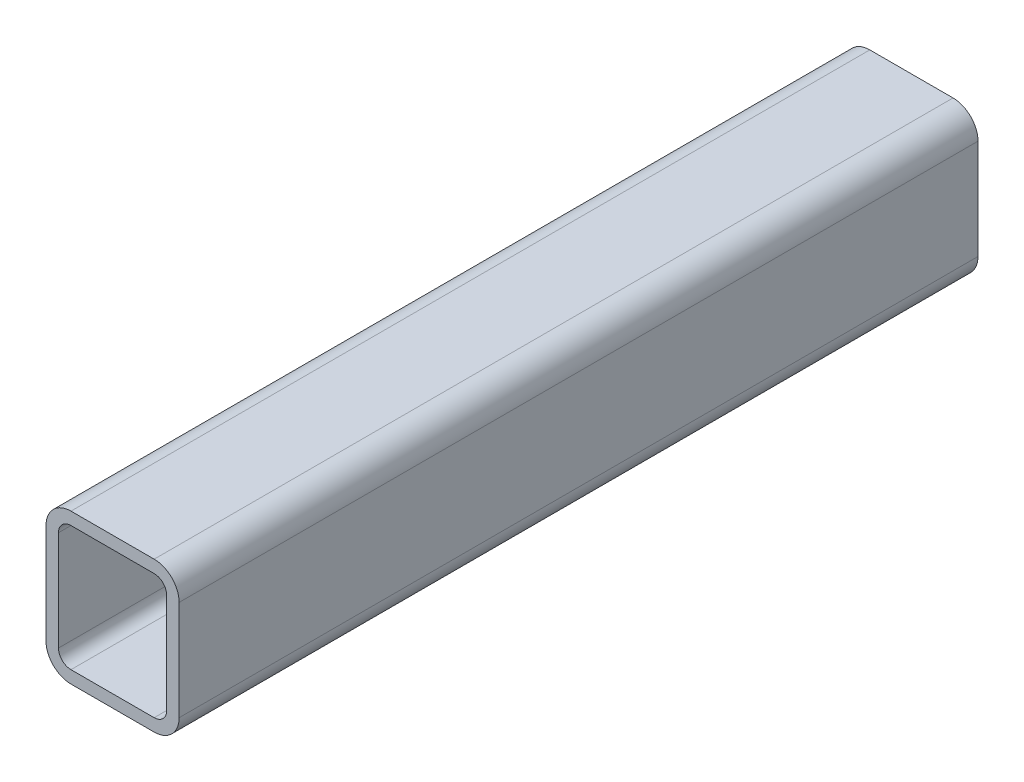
ISO-10303-21;
HEADER;
FILE_DESCRIPTION(('STEP AP214'),'2;1');
FILE_NAME('part.step','',(''),(''),'','','');
FILE_SCHEMA(('AUTOMOTIVE_DESIGN { 1 0 10303 214 1 1 1 1 }'));
ENDSEC;
DATA;
#1=APPLICATION_CONTEXT('core data for automotive mechanical design processes');
#2=APPLICATION_PROTOCOL_DEFINITION('international standard','automotive_design',2000,#1);
#3=PRODUCT_CONTEXT('',#1,'mechanical');
#4=PRODUCT('Part','Part','',(#3));
#5=PRODUCT_RELATED_PRODUCT_CATEGORY('part','',(#4));
#6=PRODUCT_DEFINITION_FORMATION('','',#4);
#7=PRODUCT_DEFINITION_CONTEXT('part definition',#1,'design');
#8=PRODUCT_DEFINITION('design','',#6,#7);
#9=PRODUCT_DEFINITION_SHAPE('','',#8);
#10=(LENGTH_UNIT() NAMED_UNIT(*) SI_UNIT(.MILLI.,.METRE.));
#11=(NAMED_UNIT(*) PLANE_ANGLE_UNIT() SI_UNIT($,.RADIAN.));
#12=(NAMED_UNIT(*) SI_UNIT($,.STERADIAN.) SOLID_ANGLE_UNIT());
#13=UNCERTAINTY_MEASURE_WITH_UNIT(LENGTH_MEASURE(1.E-05),#10,'distance_accuracy_value','');
#14=(GEOMETRIC_REPRESENTATION_CONTEXT(3) GLOBAL_UNCERTAINTY_ASSIGNED_CONTEXT((#13)) GLOBAL_UNIT_ASSIGNED_CONTEXT((#10,
#11,#12)) REPRESENTATION_CONTEXT('',''));
#15=CARTESIAN_POINT('',(0.,0.,0.));
#16=DIRECTION('',(0.,0.,1.));
#17=DIRECTION('',(1.,0.,0.));
#18=AXIS2_PLACEMENT_3D('',#15,#16,#17);
#19=CARTESIAN_POINT('',(9.525,47.625,304.8));
#20=DIRECTION('',(0.,0.,1.));
#21=DIRECTION('',(1.,0.,0.));
#22=AXIS2_PLACEMENT_3D('',#19,#20,#21);
#23=PLANE('',#22);
#24=CARTESIAN_POINT('',(9.525,47.625,304.8));
#25=DIRECTION('',(0.,0.,1.));
#26=DIRECTION('',(1.,0.,0.));
#27=AXIS2_PLACEMENT_3D('',#24,#25,#26);
#28=CIRCLE('',#27,9.52500000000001);
#29=CARTESIAN_POINT('',(9.525,57.15,304.8));
#30=VERTEX_POINT('',#29);
#31=CARTESIAN_POINT('',(0.,47.625,304.8));
#32=VERTEX_POINT('',#31);
#33=EDGE_CURVE('E211',#30,#32,#28,.T.);
#34=ORIENTED_EDGE('',*,*,#33,.T.);
#35=DIRECTION('',(0.,-1.,0.));
#36=VECTOR('',#35,1.);
#37=CARTESIAN_POINT('',(0.,9.52500000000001,304.8));
#38=LINE('',#37,#36);
#39=CARTESIAN_POINT('',(0.,9.52500000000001,304.8));
#40=VERTEX_POINT('',#39);
#41=EDGE_CURVE('E214',#32,#40,#38,.T.);
#42=ORIENTED_EDGE('',*,*,#41,.T.);
#43=CARTESIAN_POINT('',(9.525,9.52500000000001,304.8));
#44=DIRECTION('',(0.,0.,1.));
#45=DIRECTION('',(1.,0.,0.));
#46=AXIS2_PLACEMENT_3D('',#43,#44,#45);
#47=CIRCLE('',#46,9.525);
#48=CARTESIAN_POINT('',(9.525,0.,304.8));
#49=VERTEX_POINT('',#48);
#50=EDGE_CURVE('E217',#40,#49,#47,.T.);
#51=ORIENTED_EDGE('',*,*,#50,.T.);
#52=DIRECTION('',(1.,0.,0.));
#53=VECTOR('',#52,1.);
#54=CARTESIAN_POINT('',(41.275,0.,304.8));
#55=LINE('',#54,#53);
#56=CARTESIAN_POINT('',(41.275,0.,304.8));
#57=VERTEX_POINT('',#56);
#58=EDGE_CURVE('E219',#49,#57,#55,.T.);
#59=ORIENTED_EDGE('',*,*,#58,.T.);
#60=CARTESIAN_POINT('',(41.275,9.52500000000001,304.8));
#61=DIRECTION('',(0.,0.,1.));
#62=DIRECTION('',(1.,0.,0.));
#63=AXIS2_PLACEMENT_3D('',#60,#61,#62);
#64=CIRCLE('',#63,9.525);
#65=CARTESIAN_POINT('',(50.8,9.52500000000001,304.8));
#66=VERTEX_POINT('',#65);
#67=EDGE_CURVE('E221',#57,#66,#64,.T.);
#68=ORIENTED_EDGE('',*,*,#67,.T.);
#69=DIRECTION('',(0.,1.,0.));
#70=VECTOR('',#69,1.);
#71=CARTESIAN_POINT('',(50.8,47.625,304.8));
#72=LINE('',#71,#70);
#73=CARTESIAN_POINT('',(50.8,47.625,304.8));
#74=VERTEX_POINT('',#73);
#75=EDGE_CURVE('E223',#66,#74,#72,.T.);
#76=ORIENTED_EDGE('',*,*,#75,.T.);
#77=CARTESIAN_POINT('',(41.275,47.625,304.8));
#78=DIRECTION('',(0.,0.,1.));
#79=DIRECTION('',(1.,0.,0.));
#80=AXIS2_PLACEMENT_3D('',#77,#78,#79);
#81=CIRCLE('',#80,9.525);
#82=CARTESIAN_POINT('',(41.275,57.15,304.8));
#83=VERTEX_POINT('',#82);
#84=EDGE_CURVE('E225',#74,#83,#81,.T.);
#85=ORIENTED_EDGE('',*,*,#84,.T.);
#86=DIRECTION('',(-1.,0.,0.));
#87=VECTOR('',#86,1.);
#88=CARTESIAN_POINT('',(9.525,57.15,304.8));
#89=LINE('',#88,#87);
#90=EDGE_CURVE('E227',#83,#30,#89,.T.);
#91=ORIENTED_EDGE('',*,*,#90,.T.);
#92=EDGE_LOOP('',(#34,#42,#51,#59,#68,#76,#85,#91));
#93=FACE_BOUND('',#92,.T.);
#94=DIRECTION('',(0.,-1.,0.));
#95=VECTOR('',#94,1.);
#96=CARTESIAN_POINT('',(4.7625,9.52500000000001,304.8));
#97=LINE('',#96,#95);
#98=CARTESIAN_POINT('',(4.7625,47.625,304.8));
#99=VERTEX_POINT('',#98);
#100=CARTESIAN_POINT('',(4.7625,9.52500000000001,304.8));
#101=VERTEX_POINT('',#100);
#102=EDGE_CURVE('E154',#99,#101,#97,.T.);
#103=ORIENTED_EDGE('',*,*,#102,.F.);
#104=CARTESIAN_POINT('',(9.525,47.625,304.8));
#105=DIRECTION('',(0.,0.,1.));
#106=DIRECTION('',(1.,0.,0.));
#107=AXIS2_PLACEMENT_3D('',#104,#105,#106);
#108=CIRCLE('',#107,4.7625);
#109=CARTESIAN_POINT('',(9.525,52.3875,304.8));
#110=VERTEX_POINT('',#109);
#111=EDGE_CURVE('E146',#110,#99,#108,.T.);
#112=ORIENTED_EDGE('',*,*,#111,.F.);
#113=DIRECTION('',(-1.,0.,0.));
#114=VECTOR('',#113,1.);
#115=CARTESIAN_POINT('',(9.525,52.3875,304.8));
#116=LINE('',#115,#114);
#117=CARTESIAN_POINT('',(41.275,52.3875,304.8));
#118=VERTEX_POINT('',#117);
#119=EDGE_CURVE('E179',#118,#110,#116,.T.);
#120=ORIENTED_EDGE('',*,*,#119,.F.);
#121=CARTESIAN_POINT('',(41.275,47.625,304.8));
#122=DIRECTION('',(0.,0.,1.));
#123=DIRECTION('',(1.,0.,0.));
#124=AXIS2_PLACEMENT_3D('',#121,#122,#123);
#125=CIRCLE('',#124,4.7625);
#126=CARTESIAN_POINT('',(46.0375,47.625,304.8));
#127=VERTEX_POINT('',#126);
#128=EDGE_CURVE('E177',#127,#118,#125,.T.);
#129=ORIENTED_EDGE('',*,*,#128,.F.);
#130=DIRECTION('',(0.,1.,0.));
#131=VECTOR('',#130,1.);
#132=CARTESIAN_POINT('',(46.0375,47.625,304.8));
#133=LINE('',#132,#131);
#134=CARTESIAN_POINT('',(46.0375,9.52500000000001,304.8));
#135=VERTEX_POINT('',#134);
#136=EDGE_CURVE('E175',#135,#127,#133,.T.);
#137=ORIENTED_EDGE('',*,*,#136,.F.);
#138=CARTESIAN_POINT('',(41.275,9.52500000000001,304.8));
#139=DIRECTION('',(0.,0.,1.));
#140=DIRECTION('',(1.,0.,0.));
#141=AXIS2_PLACEMENT_3D('',#138,#139,#140);
#142=CIRCLE('',#141,4.7625);
#143=CARTESIAN_POINT('',(41.275,4.7625,304.8));
#144=VERTEX_POINT('',#143);
#145=EDGE_CURVE('E173',#144,#135,#142,.T.);
#146=ORIENTED_EDGE('',*,*,#145,.F.);
#147=DIRECTION('',(1.,0.,0.));
#148=VECTOR('',#147,1.);
#149=CARTESIAN_POINT('',(41.275,4.76250000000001,304.8));
#150=LINE('',#149,#148);
#151=CARTESIAN_POINT('',(9.525,4.76250000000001,304.8));
#152=VERTEX_POINT('',#151);
#153=EDGE_CURVE('E169',#152,#144,#150,.T.);
#154=ORIENTED_EDGE('',*,*,#153,.F.);
#155=CARTESIAN_POINT('',(9.525,9.52500000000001,304.8));
#156=DIRECTION('',(0.,0.,1.));
#157=DIRECTION('',(1.,0.,0.));
#158=AXIS2_PLACEMENT_3D('',#155,#156,#157);
#159=CIRCLE('',#158,4.7625);
#160=EDGE_CURVE('E167',#101,#152,#159,.T.);
#161=ORIENTED_EDGE('',*,*,#160,.F.);
#162=EDGE_LOOP('',(#103,#112,#120,#129,#137,#146,#154,#161));
#163=FACE_BOUND('',#162,.T.);
#164=ADVANCED_FACE('F33',(#93,#163),#23,.T.);
#165=CARTESIAN_POINT('',(9.525,47.625,0.));
#166=DIRECTION('',(0.,0.,1.));
#167=DIRECTION('',(1.,0.,0.));
#168=AXIS2_PLACEMENT_3D('',#165,#166,#167);
#169=PLANE('',#168);
#170=CARTESIAN_POINT('',(9.525,47.625,0.));
#171=DIRECTION('',(0.,0.,1.));
#172=DIRECTION('',(1.,0.,0.));
#173=AXIS2_PLACEMENT_3D('',#170,#171,#172);
#174=CIRCLE('',#173,9.52500000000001);
#175=CARTESIAN_POINT('',(9.525,57.15,0.));
#176=VERTEX_POINT('',#175);
#177=CARTESIAN_POINT('',(0.,47.625,0.));
#178=VERTEX_POINT('',#177);
#179=EDGE_CURVE('E162',#176,#178,#174,.T.);
#180=ORIENTED_EDGE('',*,*,#179,.F.);
#181=DIRECTION('',(-1.,0.,0.));
#182=VECTOR('',#181,1.);
#183=CARTESIAN_POINT('',(9.525,57.15,0.));
#184=LINE('',#183,#182);
#185=CARTESIAN_POINT('',(41.275,57.15,0.));
#186=VERTEX_POINT('',#185);
#187=EDGE_CURVE('E215',#186,#176,#184,.T.);
#188=ORIENTED_EDGE('',*,*,#187,.F.);
#189=CARTESIAN_POINT('',(41.275,47.625,0.));
#190=DIRECTION('',(0.,0.,1.));
#191=DIRECTION('',(1.,0.,0.));
#192=AXIS2_PLACEMENT_3D('',#189,#190,#191);
#193=CIRCLE('',#192,9.525);
#194=CARTESIAN_POINT('',(50.8,47.625,0.));
#195=VERTEX_POINT('',#194);
#196=EDGE_CURVE('E242',#195,#186,#193,.T.);
#197=ORIENTED_EDGE('',*,*,#196,.F.);
#198=DIRECTION('',(0.,1.,0.));
#199=VECTOR('',#198,1.);
#200=CARTESIAN_POINT('',(50.8,47.625,0.));
#201=LINE('',#200,#199);
#202=CARTESIAN_POINT('',(50.8,9.52500000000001,0.));
#203=VERTEX_POINT('',#202);
#204=EDGE_CURVE('E240',#203,#195,#201,.T.);
#205=ORIENTED_EDGE('',*,*,#204,.F.);
#206=CARTESIAN_POINT('',(41.275,9.52500000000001,0.));
#207=DIRECTION('',(0.,0.,1.));
#208=DIRECTION('',(1.,0.,0.));
#209=AXIS2_PLACEMENT_3D('',#206,#207,#208);
#210=CIRCLE('',#209,9.525);
#211=CARTESIAN_POINT('',(41.275,0.,0.));
#212=VERTEX_POINT('',#211);
#213=EDGE_CURVE('E238',#212,#203,#210,.T.);
#214=ORIENTED_EDGE('',*,*,#213,.F.);
#215=DIRECTION('',(1.,0.,0.));
#216=VECTOR('',#215,1.);
#217=CARTESIAN_POINT('',(41.275,0.,0.));
#218=LINE('',#217,#216);
#219=CARTESIAN_POINT('',(9.525,0.,0.));
#220=VERTEX_POINT('',#219);
#221=EDGE_CURVE('E236',#220,#212,#218,.T.);
#222=ORIENTED_EDGE('',*,*,#221,.F.);
#223=CARTESIAN_POINT('',(9.525,9.52500000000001,0.));
#224=DIRECTION('',(0.,0.,1.));
#225=DIRECTION('',(1.,0.,0.));
#226=AXIS2_PLACEMENT_3D('',#223,#224,#225);
#227=CIRCLE('',#226,9.525);
#228=CARTESIAN_POINT('',(0.,9.52500000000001,0.));
#229=VERTEX_POINT('',#228);
#230=EDGE_CURVE('E234',#229,#220,#227,.T.);
#231=ORIENTED_EDGE('',*,*,#230,.F.);
#232=DIRECTION('',(0.,-1.,0.));
#233=VECTOR('',#232,1.);
#234=CARTESIAN_POINT('',(0.,9.52500000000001,0.));
#235=LINE('',#234,#233);
#236=EDGE_CURVE('E232',#178,#229,#235,.T.);
#237=ORIENTED_EDGE('',*,*,#236,.F.);
#238=EDGE_LOOP('',(#180,#188,#197,#205,#214,#222,#231,#237));
#239=FACE_BOUND('',#238,.T.);
#240=CARTESIAN_POINT('',(9.525,47.625,0.));
#241=DIRECTION('',(0.,0.,1.));
#242=DIRECTION('',(1.,0.,0.));
#243=AXIS2_PLACEMENT_3D('',#240,#241,#242);
#244=CIRCLE('',#243,4.7625);
#245=CARTESIAN_POINT('',(9.525,52.3875,0.));
#246=VERTEX_POINT('',#245);
#247=CARTESIAN_POINT('',(4.7625,47.625,0.));
#248=VERTEX_POINT('',#247);
#249=EDGE_CURVE('E56',#246,#248,#244,.T.);
#250=ORIENTED_EDGE('',*,*,#249,.T.);
#251=DIRECTION('',(0.,-1.,0.));
#252=VECTOR('',#251,1.);
#253=CARTESIAN_POINT('',(4.7625,9.52500000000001,0.));
#254=LINE('',#253,#252);
#255=CARTESIAN_POINT('',(4.7625,9.52500000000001,0.));
#256=VERTEX_POINT('',#255);
#257=EDGE_CURVE('E161',#248,#256,#254,.T.);
#258=ORIENTED_EDGE('',*,*,#257,.T.);
#259=CARTESIAN_POINT('',(9.525,9.52500000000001,0.));
#260=DIRECTION('',(0.,0.,1.));
#261=DIRECTION('',(1.,0.,0.));
#262=AXIS2_PLACEMENT_3D('',#259,#260,#261);
#263=CIRCLE('',#262,4.7625);
#264=CARTESIAN_POINT('',(9.525,4.76250000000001,0.));
#265=VERTEX_POINT('',#264);
#266=EDGE_CURVE('E183',#256,#265,#263,.T.);
#267=ORIENTED_EDGE('',*,*,#266,.T.);
#268=DIRECTION('',(1.,0.,0.));
#269=VECTOR('',#268,1.);
#270=CARTESIAN_POINT('',(41.275,4.76250000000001,0.));
#271=LINE('',#270,#269);
#272=CARTESIAN_POINT('',(41.275,4.7625,0.));
#273=VERTEX_POINT('',#272);
#274=EDGE_CURVE('E186',#265,#273,#271,.T.);
#275=ORIENTED_EDGE('',*,*,#274,.T.);
#276=CARTESIAN_POINT('',(41.275,9.52500000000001,0.));
#277=DIRECTION('',(0.,0.,1.));
#278=DIRECTION('',(1.,0.,0.));
#279=AXIS2_PLACEMENT_3D('',#276,#277,#278);
#280=CIRCLE('',#279,4.7625);
#281=CARTESIAN_POINT('',(46.0375,9.52500000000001,0.));
#282=VERTEX_POINT('',#281);
#283=EDGE_CURVE('E189',#273,#282,#280,.T.);
#284=ORIENTED_EDGE('',*,*,#283,.T.);
#285=DIRECTION('',(0.,1.,0.));
#286=VECTOR('',#285,1.);
#287=CARTESIAN_POINT('',(46.0375,47.625,0.));
#288=LINE('',#287,#286);
#289=CARTESIAN_POINT('',(46.0375,47.625,0.));
#290=VERTEX_POINT('',#289);
#291=EDGE_CURVE('E192',#282,#290,#288,.T.);
#292=ORIENTED_EDGE('',*,*,#291,.T.);
#293=CARTESIAN_POINT('',(41.275,47.625,0.));
#294=DIRECTION('',(0.,0.,1.));
#295=DIRECTION('',(1.,0.,0.));
#296=AXIS2_PLACEMENT_3D('',#293,#294,#295);
#297=CIRCLE('',#296,4.7625);
#298=CARTESIAN_POINT('',(41.275,52.3875,0.));
#299=VERTEX_POINT('',#298);
#300=EDGE_CURVE('E195',#290,#299,#297,.T.);
#301=ORIENTED_EDGE('',*,*,#300,.T.);
#302=DIRECTION('',(-1.,0.,0.));
#303=VECTOR('',#302,1.);
#304=CARTESIAN_POINT('',(9.525,52.3875,0.));
#305=LINE('',#304,#303);
#306=EDGE_CURVE('E155',#299,#246,#305,.T.);
#307=ORIENTED_EDGE('',*,*,#306,.T.);
#308=EDGE_LOOP('',(#250,#258,#267,#275,#284,#292,#301,#307));
#309=FACE_BOUND('',#308,.T.);
#310=ADVANCED_FACE('F272',(#239,#309),#169,.F.);
#311=CARTESIAN_POINT('',(9.525,47.625,304.8));
#312=DIRECTION('',(0.,0.,-1.));
#313=DIRECTION('',(-1.,0.,0.));
#314=AXIS2_PLACEMENT_3D('',#311,#312,#313);
#315=CYLINDRICAL_SURFACE('',#314,9.52500000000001);
#316=ORIENTED_EDGE('',*,*,#179,.T.);
#317=DIRECTION('',(0.,0.,-1.));
#318=VECTOR('',#317,1.);
#319=CARTESIAN_POINT('',(0.,47.625,304.8));
#320=LINE('',#319,#318);
#321=EDGE_CURVE('E11',#32,#178,#320,.T.);
#322=ORIENTED_EDGE('',*,*,#321,.F.);
#323=ORIENTED_EDGE('',*,*,#33,.F.);
#324=DIRECTION('',(0.,0.,-1.));
#325=VECTOR('',#324,1.);
#326=CARTESIAN_POINT('',(9.525,57.15,304.8));
#327=LINE('',#326,#325);
#328=EDGE_CURVE('E229',#30,#176,#327,.T.);
#329=ORIENTED_EDGE('',*,*,#328,.T.);
#330=EDGE_LOOP('',(#316,#322,#323,#329));
#331=FACE_BOUND('',#330,.T.);
#332=ADVANCED_FACE('F35',(#331),#315,.T.);
#333=CARTESIAN_POINT('',(0.,9.52500000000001,304.8));
#334=DIRECTION('',(1.,0.,0.));
#335=DIRECTION('',(0.,0.,-1.));
#336=AXIS2_PLACEMENT_3D('',#333,#334,#335);
#337=PLANE('',#336);
#338=ORIENTED_EDGE('',*,*,#236,.T.);
#339=DIRECTION('',(0.,0.,-1.));
#340=VECTOR('',#339,1.);
#341=CARTESIAN_POINT('',(0.,9.52500000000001,304.8));
#342=LINE('',#341,#340);
#343=EDGE_CURVE('E41',#40,#229,#342,.T.);
#344=ORIENTED_EDGE('',*,*,#343,.F.);
#345=ORIENTED_EDGE('',*,*,#41,.F.);
#346=ORIENTED_EDGE('',*,*,#321,.T.);
#347=EDGE_LOOP('',(#338,#344,#345,#346));
#348=FACE_BOUND('',#347,.T.);
#349=ADVANCED_FACE('F289',(#348),#337,.F.);
#350=CARTESIAN_POINT('',(9.525,9.52500000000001,304.8));
#351=DIRECTION('',(0.,0.,-1.));
#352=DIRECTION('',(-1.,0.,0.));
#353=AXIS2_PLACEMENT_3D('',#350,#351,#352);
#354=CYLINDRICAL_SURFACE('',#353,9.525);
#355=ORIENTED_EDGE('',*,*,#230,.T.);
#356=DIRECTION('',(0.,0.,-1.));
#357=VECTOR('',#356,1.);
#358=CARTESIAN_POINT('',(9.525,0.,304.8));
#359=LINE('',#358,#357);
#360=EDGE_CURVE('E259',#49,#220,#359,.T.);
#361=ORIENTED_EDGE('',*,*,#360,.F.);
#362=ORIENTED_EDGE('',*,*,#50,.F.);
#363=ORIENTED_EDGE('',*,*,#343,.T.);
#364=EDGE_LOOP('',(#355,#361,#362,#363));
#365=FACE_BOUND('',#364,.T.);
#366=ADVANCED_FACE('F266',(#365),#354,.T.);
#367=CARTESIAN_POINT('',(41.275,0.,304.8));
#368=DIRECTION('',(0.,1.,0.));
#369=DIRECTION('',(0.,0.,1.));
#370=AXIS2_PLACEMENT_3D('',#367,#368,#369);
#371=PLANE('',#370);
#372=ORIENTED_EDGE('',*,*,#221,.T.);
#373=DIRECTION('',(0.,0.,-1.));
#374=VECTOR('',#373,1.);
#375=CARTESIAN_POINT('',(41.275,0.,304.8));
#376=LINE('',#375,#374);
#377=EDGE_CURVE('E256',#57,#212,#376,.T.);
#378=ORIENTED_EDGE('',*,*,#377,.F.);
#379=ORIENTED_EDGE('',*,*,#58,.F.);
#380=ORIENTED_EDGE('',*,*,#360,.T.);
#381=EDGE_LOOP('',(#372,#378,#379,#380));
#382=FACE_BOUND('',#381,.T.);
#383=ADVANCED_FACE('F278',(#382),#371,.F.);
#384=CARTESIAN_POINT('',(41.275,9.52500000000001,304.8));
#385=DIRECTION('',(0.,0.,-1.));
#386=DIRECTION('',(-1.,0.,0.));
#387=AXIS2_PLACEMENT_3D('',#384,#385,#386);
#388=CYLINDRICAL_SURFACE('',#387,9.525);
#389=ORIENTED_EDGE('',*,*,#213,.T.);
#390=DIRECTION('',(0.,0.,-1.));
#391=VECTOR('',#390,1.);
#392=CARTESIAN_POINT('',(50.8,9.52500000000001,304.8));
#393=LINE('',#392,#391);
#394=EDGE_CURVE('E253',#66,#203,#393,.T.);
#395=ORIENTED_EDGE('',*,*,#394,.F.);
#396=ORIENTED_EDGE('',*,*,#67,.F.);
#397=ORIENTED_EDGE('',*,*,#377,.T.);
#398=EDGE_LOOP('',(#389,#395,#396,#397));
#399=FACE_BOUND('',#398,.T.);
#400=ADVANCED_FACE('F282',(#399),#388,.T.);
#401=CARTESIAN_POINT('',(50.8,47.625,304.8));
#402=DIRECTION('',(-1.,0.,0.));
#403=DIRECTION('',(0.,0.,1.));
#404=AXIS2_PLACEMENT_3D('',#401,#402,#403);
#405=PLANE('',#404);
#406=ORIENTED_EDGE('',*,*,#204,.T.);
#407=DIRECTION('',(0.,0.,-1.));
#408=VECTOR('',#407,1.);
#409=CARTESIAN_POINT('',(50.8,47.625,304.8));
#410=LINE('',#409,#408);
#411=EDGE_CURVE('E250',#74,#195,#410,.T.);
#412=ORIENTED_EDGE('',*,*,#411,.F.);
#413=ORIENTED_EDGE('',*,*,#75,.F.);
#414=ORIENTED_EDGE('',*,*,#394,.T.);
#415=EDGE_LOOP('',(#406,#412,#413,#414));
#416=FACE_BOUND('',#415,.T.);
#417=ADVANCED_FACE('F302',(#416),#405,.F.);
#418=CARTESIAN_POINT('',(41.275,47.625,304.8));
#419=DIRECTION('',(0.,0.,-1.));
#420=DIRECTION('',(-1.,0.,0.));
#421=AXIS2_PLACEMENT_3D('',#418,#419,#420);
#422=CYLINDRICAL_SURFACE('',#421,9.525);
#423=ORIENTED_EDGE('',*,*,#196,.T.);
#424=DIRECTION('',(0.,0.,-1.));
#425=VECTOR('',#424,1.);
#426=CARTESIAN_POINT('',(41.275,57.15,304.8));
#427=LINE('',#426,#425);
#428=EDGE_CURVE('E247',#83,#186,#427,.T.);
#429=ORIENTED_EDGE('',*,*,#428,.F.);
#430=ORIENTED_EDGE('',*,*,#84,.F.);
#431=ORIENTED_EDGE('',*,*,#411,.T.);
#432=EDGE_LOOP('',(#423,#429,#430,#431));
#433=FACE_BOUND('',#432,.T.);
#434=ADVANCED_FACE('F300',(#433),#422,.T.);
#435=CARTESIAN_POINT('',(9.525,57.15,304.8));
#436=DIRECTION('',(0.,-1.,0.));
#437=DIRECTION('',(0.,0.,-1.));
#438=AXIS2_PLACEMENT_3D('',#435,#436,#437);
#439=PLANE('',#438);
#440=ORIENTED_EDGE('',*,*,#187,.T.);
#441=ORIENTED_EDGE('',*,*,#328,.F.);
#442=ORIENTED_EDGE('',*,*,#90,.F.);
#443=ORIENTED_EDGE('',*,*,#428,.T.);
#444=EDGE_LOOP('',(#440,#441,#442,#443));
#445=FACE_BOUND('',#444,.T.);
#446=ADVANCED_FACE('F295',(#445),#439,.F.);
#447=CARTESIAN_POINT('',(9.525,47.625,304.8));
#448=DIRECTION('',(0.,0.,-1.));
#449=DIRECTION('',(-1.,0.,0.));
#450=AXIS2_PLACEMENT_3D('',#447,#448,#449);
#451=CYLINDRICAL_SURFACE('',#450,4.7625);
#452=ORIENTED_EDGE('',*,*,#249,.F.);
#453=DIRECTION('',(0.,0.,-1.));
#454=VECTOR('',#453,1.);
#455=CARTESIAN_POINT('',(9.525,52.3875,304.8));
#456=LINE('',#455,#454);
#457=EDGE_CURVE('E150',#110,#246,#456,.T.);
#458=ORIENTED_EDGE('',*,*,#457,.F.);
#459=ORIENTED_EDGE('',*,*,#111,.T.);
#460=DIRECTION('',(0.,0.,-1.));
#461=VECTOR('',#460,1.);
#462=CARTESIAN_POINT('',(4.7625,47.625,304.8));
#463=LINE('',#462,#461);
#464=EDGE_CURVE('E149',#99,#248,#463,.T.);
#465=ORIENTED_EDGE('',*,*,#464,.T.);
#466=EDGE_LOOP('',(#452,#458,#459,#465));
#467=FACE_BOUND('',#466,.T.);
#468=ADVANCED_FACE('F148',(#467),#451,.F.);
#469=CARTESIAN_POINT('',(4.7625,9.52500000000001,304.8));
#470=DIRECTION('',(1.,0.,0.));
#471=DIRECTION('',(0.,0.,-1.));
#472=AXIS2_PLACEMENT_3D('',#469,#470,#471);
#473=PLANE('',#472);
#474=ORIENTED_EDGE('',*,*,#257,.F.);
#475=ORIENTED_EDGE('',*,*,#464,.F.);
#476=ORIENTED_EDGE('',*,*,#102,.T.);
#477=DIRECTION('',(0.,0.,-1.));
#478=VECTOR('',#477,1.);
#479=CARTESIAN_POINT('',(4.7625,9.52500000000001,304.8));
#480=LINE('',#479,#478);
#481=EDGE_CURVE('E163',#101,#256,#480,.T.);
#482=ORIENTED_EDGE('',*,*,#481,.T.);
#483=EDGE_LOOP('',(#474,#475,#476,#482));
#484=FACE_BOUND('',#483,.T.);
#485=ADVANCED_FACE('F158',(#484),#473,.T.);
#486=CARTESIAN_POINT('',(9.525,9.52500000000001,304.8));
#487=DIRECTION('',(0.,0.,-1.));
#488=DIRECTION('',(-1.,0.,0.));
#489=AXIS2_PLACEMENT_3D('',#486,#487,#488);
#490=CYLINDRICAL_SURFACE('',#489,4.7625);
#491=ORIENTED_EDGE('',*,*,#266,.F.);
#492=ORIENTED_EDGE('',*,*,#481,.F.);
#493=ORIENTED_EDGE('',*,*,#160,.T.);
#494=DIRECTION('',(0.,0.,-1.));
#495=VECTOR('',#494,1.);
#496=CARTESIAN_POINT('',(9.525,4.76250000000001,304.8));
#497=LINE('',#496,#495);
#498=EDGE_CURVE('E208',#152,#265,#497,.T.);
#499=ORIENTED_EDGE('',*,*,#498,.T.);
#500=EDGE_LOOP('',(#491,#492,#493,#499));
#501=FACE_BOUND('',#500,.T.);
#502=ADVANCED_FACE('F327',(#501),#490,.F.);
#503=CARTESIAN_POINT('',(41.275,4.76250000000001,304.8));
#504=DIRECTION('',(0.,1.,0.));
#505=DIRECTION('',(0.,0.,1.));
#506=AXIS2_PLACEMENT_3D('',#503,#504,#505);
#507=PLANE('',#506);
#508=ORIENTED_EDGE('',*,*,#274,.F.);
#509=ORIENTED_EDGE('',*,*,#498,.F.);
#510=ORIENTED_EDGE('',*,*,#153,.T.);
#511=DIRECTION('',(0.,0.,-1.));
#512=VECTOR('',#511,1.);
#513=CARTESIAN_POINT('',(41.275,4.7625,304.8));
#514=LINE('',#513,#512);
#515=EDGE_CURVE('E206',#144,#273,#514,.T.);
#516=ORIENTED_EDGE('',*,*,#515,.T.);
#517=EDGE_LOOP('',(#508,#509,#510,#516));
#518=FACE_BOUND('',#517,.T.);
#519=ADVANCED_FACE('F331',(#518),#507,.T.);
#520=CARTESIAN_POINT('',(41.275,9.52500000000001,304.8));
#521=DIRECTION('',(0.,0.,-1.));
#522=DIRECTION('',(-1.,0.,0.));
#523=AXIS2_PLACEMENT_3D('',#520,#521,#522);
#524=CYLINDRICAL_SURFACE('',#523,4.7625);
#525=ORIENTED_EDGE('',*,*,#283,.F.);
#526=ORIENTED_EDGE('',*,*,#515,.F.);
#527=ORIENTED_EDGE('',*,*,#145,.T.);
#528=DIRECTION('',(0.,0.,-1.));
#529=VECTOR('',#528,1.);
#530=CARTESIAN_POINT('',(46.0375,9.52500000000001,304.8));
#531=LINE('',#530,#529);
#532=EDGE_CURVE('E204',#135,#282,#531,.T.);
#533=ORIENTED_EDGE('',*,*,#532,.T.);
#534=EDGE_LOOP('',(#525,#526,#527,#533));
#535=FACE_BOUND('',#534,.T.);
#536=ADVANCED_FACE('F337',(#535),#524,.F.);
#537=CARTESIAN_POINT('',(46.0375,47.625,304.8));
#538=DIRECTION('',(-1.,0.,0.));
#539=DIRECTION('',(0.,0.,1.));
#540=AXIS2_PLACEMENT_3D('',#537,#538,#539);
#541=PLANE('',#540);
#542=ORIENTED_EDGE('',*,*,#291,.F.);
#543=ORIENTED_EDGE('',*,*,#532,.F.);
#544=ORIENTED_EDGE('',*,*,#136,.T.);
#545=DIRECTION('',(0.,0.,-1.));
#546=VECTOR('',#545,1.);
#547=CARTESIAN_POINT('',(46.0375,47.625,304.8));
#548=LINE('',#547,#546);
#549=EDGE_CURVE('E202',#127,#290,#548,.T.);
#550=ORIENTED_EDGE('',*,*,#549,.T.);
#551=EDGE_LOOP('',(#542,#543,#544,#550));
#552=FACE_BOUND('',#551,.T.);
#553=ADVANCED_FACE('F341',(#552),#541,.T.);
#554=CARTESIAN_POINT('',(41.275,47.625,304.8));
#555=DIRECTION('',(0.,0.,-1.));
#556=DIRECTION('',(-1.,0.,0.));
#557=AXIS2_PLACEMENT_3D('',#554,#555,#556);
#558=CYLINDRICAL_SURFACE('',#557,4.7625);
#559=ORIENTED_EDGE('',*,*,#300,.F.);
#560=ORIENTED_EDGE('',*,*,#549,.F.);
#561=ORIENTED_EDGE('',*,*,#128,.T.);
#562=DIRECTION('',(0.,0.,-1.));
#563=VECTOR('',#562,1.);
#564=CARTESIAN_POINT('',(41.275,52.3875,304.8));
#565=LINE('',#564,#563);
#566=EDGE_CURVE('E48',#118,#299,#565,.T.);
#567=ORIENTED_EDGE('',*,*,#566,.T.);
#568=EDGE_LOOP('',(#559,#560,#561,#567));
#569=FACE_BOUND('',#568,.T.);
#570=ADVANCED_FACE('F345',(#569),#558,.F.);
#571=CARTESIAN_POINT('',(9.525,52.3875,304.8));
#572=DIRECTION('',(0.,-1.,0.));
#573=DIRECTION('',(0.,0.,-1.));
#574=AXIS2_PLACEMENT_3D('',#571,#572,#573);
#575=PLANE('',#574);
#576=ORIENTED_EDGE('',*,*,#306,.F.);
#577=ORIENTED_EDGE('',*,*,#566,.F.);
#578=ORIENTED_EDGE('',*,*,#119,.T.);
#579=ORIENTED_EDGE('',*,*,#457,.T.);
#580=EDGE_LOOP('',(#576,#577,#578,#579));
#581=FACE_BOUND('',#580,.T.);
#582=ADVANCED_FACE('F349',(#581),#575,.T.);
#583=CLOSED_SHELL('',(#164,#310,#332,#349,#366,#383,#400,#417,#434,#446,#468,#485,#502,#519,
#536,#553,#570,#582));
#584=MANIFOLD_SOLID_BREP('B2',#583);
#585=ADVANCED_BREP_SHAPE_REPRESENTATION('',(#18,#584),#14);
#586=SHAPE_DEFINITION_REPRESENTATION(#9,#585);
ENDSEC;
END-ISO-10303-21;
